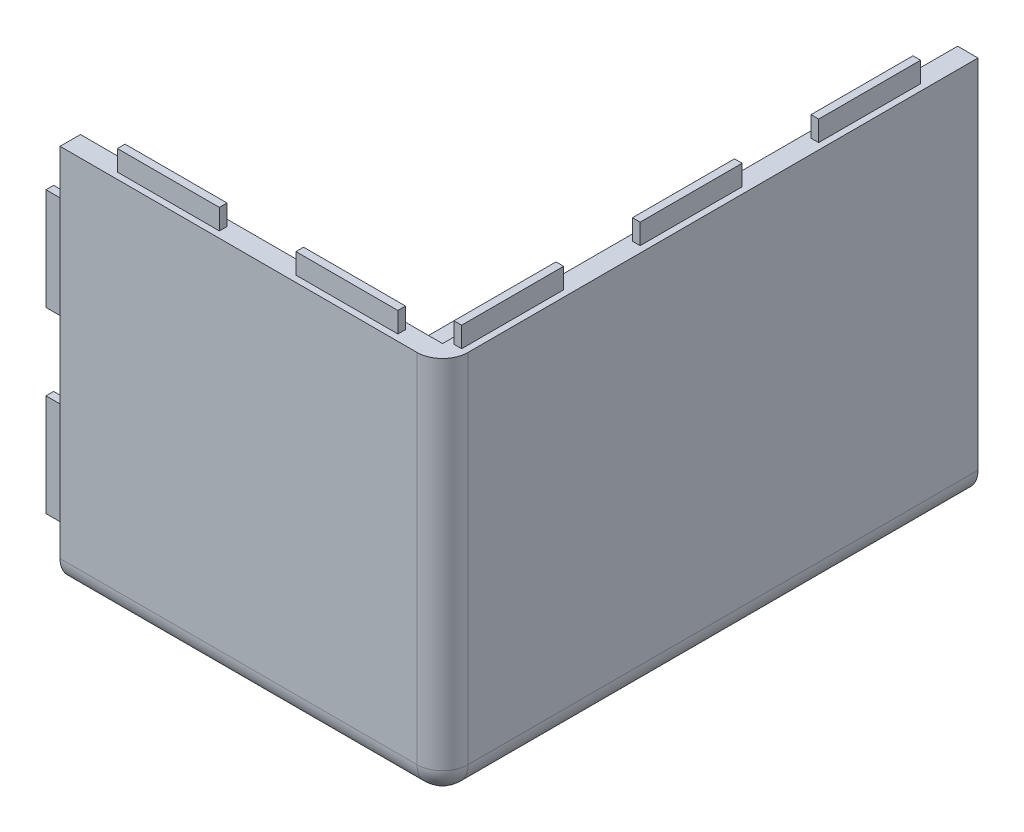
from build123d import *

# Parameters (mm, degrees)
CROQUIS1_W              = 150
CROQUIS1_H              = 210
SALIENTE_EXTRUIR1_DEPTH = 150
CROQUIS2_W              = 142
CROQUIS2_H              = 202
CORTAR_EXTRUIR1_DEPTH   = 142
CROQUIS3_W              = 40
CROQUIS3_H              = 3
CROQUIS3_W_2            = 3
CROQUIS3_H_2            = 40
SALIENTE_EXTRUIR2_DEPTH = 8
CROQUIS5_W              = 40
CROQUIS5_H              = 3
CROQUIS5_W_2            = 3
CROQUIS5_H_2            = 40
SALIENTE_EXTRUIR3_DEPTH = 8
CROQUIS6_W              = 3
CROQUIS6_H              = 40
CROQUIS6_W_2            = 40
CROQUIS6_H_2            = 3
CORTAR_EXTRUIR2_DEPTH   = 8
CROQUIS7_W              = 30
CROQUIS7_H              = 60
CORTAR_EXTRUIR3_DEPTH   = 8
REDONDEO1_R             = 10


with BuildPart() as part:
    # Croquis1 → Saliente-Extruir1 (new body)
    with BuildSketch(Plane(origin=(0, 0, 0), x_dir=(1, 0, 0), z_dir=(0, 1, 0))):
        with Locations((75, 105)):
            Rectangle(CROQUIS1_W, CROQUIS1_H)
    extrude(amount=SALIENTE_EXTRUIR1_DEPTH)

    # Croquis2 → Cortar-Extruir1 (cut)
    with BuildSketch(Plane(origin=(0, 150, 0), x_dir=(1, 0, 0), z_dir=(0, 1, 0))):
        with Locations((71, 109)):
            Rectangle(CROQUIS2_W, CROQUIS2_H)
    extrude(amount=-CORTAR_EXTRUIR1_DEPTH, mode=Mode.SUBTRACT)

    # Croquis3 → Saliente-Extruir2 (add)
    with BuildSketch(Plane(origin=(0, 150, 0), x_dir=(1, 0, 0), z_dir=(0, 1, 0))):
        with Locations((40, 4)):
            Rectangle(CROQUIS3_W, CROQUIS3_H)
        with Locations((110, 4)):
            Rectangle(CROQUIS3_W, CROQUIS3_H)
        with Locations((146, 170)):
            Rectangle(CROQUIS3_W_2, CROQUIS3_H_2)
        with Locations((146, 100)):
            Rectangle(CROQUIS3_W_2, CROQUIS3_H_2)
        with Locations((146, 30)):
            Rectangle(CROQUIS3_W_2, CROQUIS3_H_2)
    extrude(amount=SALIENTE_EXTRUIR2_DEPTH)

    # Croquis5 → Saliente-Extruir3 (add)
    with BuildSketch(Plane.ZY):
        with Locations((-170, 4)):
            Rectangle(CROQUIS5_W, CROQUIS5_H)
        with Locations((-100, 4)):
            Rectangle(CROQUIS5_W, CROQUIS5_H)
        with Locations((-30, 4)):
            Rectangle(CROQUIS5_W, CROQUIS5_H)
        with Locations((-4, 110)):
            Rectangle(CROQUIS5_W_2, CROQUIS5_H_2)
        with Locations((-4, 40)):
            Rectangle(CROQUIS5_W_2, CROQUIS5_H_2)
    extrude(amount=SALIENTE_EXTRUIR3_DEPTH)

    # Croquis6 → Cortar-Extruir2 (cut)
    with BuildSketch(Plane(origin=(0, 0, -210), x_dir=(-1, 0, 0), z_dir=(0, 0, -1))):
        with Locations((-146, 110)):
            Rectangle(CROQUIS6_W, CROQUIS6_H)
        with Locations((-146, 40)):
            Rectangle(CROQUIS6_W, CROQUIS6_H)
        with Locations((-110, 4)):
            Rectangle(CROQUIS6_W_2, CROQUIS6_H_2)
        with Locations((-40, 4)):
            Rectangle(CROQUIS6_W_2, CROQUIS6_H_2)
    extrude(amount=-CORTAR_EXTRUIR2_DEPTH, mode=Mode.SUBTRACT)

    # Croquis7 → Cortar-Extruir3 (cut)
    with BuildSketch(Plane(origin=(0, 8, 0), x_dir=(1, 0, 0), z_dir=(0, 1, 0))):
        with Locations((65, 130)):
            Rectangle(CROQUIS7_W, CROQUIS7_H)
    extrude(amount=-CORTAR_EXTRUIR3_DEPTH, mode=Mode.SUBTRACT)

    # Redondeo1
    redondeo1_edges = [part.edges().sort_by_distance(p)[0] for p in [
        (150, 0, -105),
        (75, 0, 0),
        (150, 75, 0),
    ]]
    fillet(redondeo1_edges, radius=REDONDEO1_R)


solid = part.part
